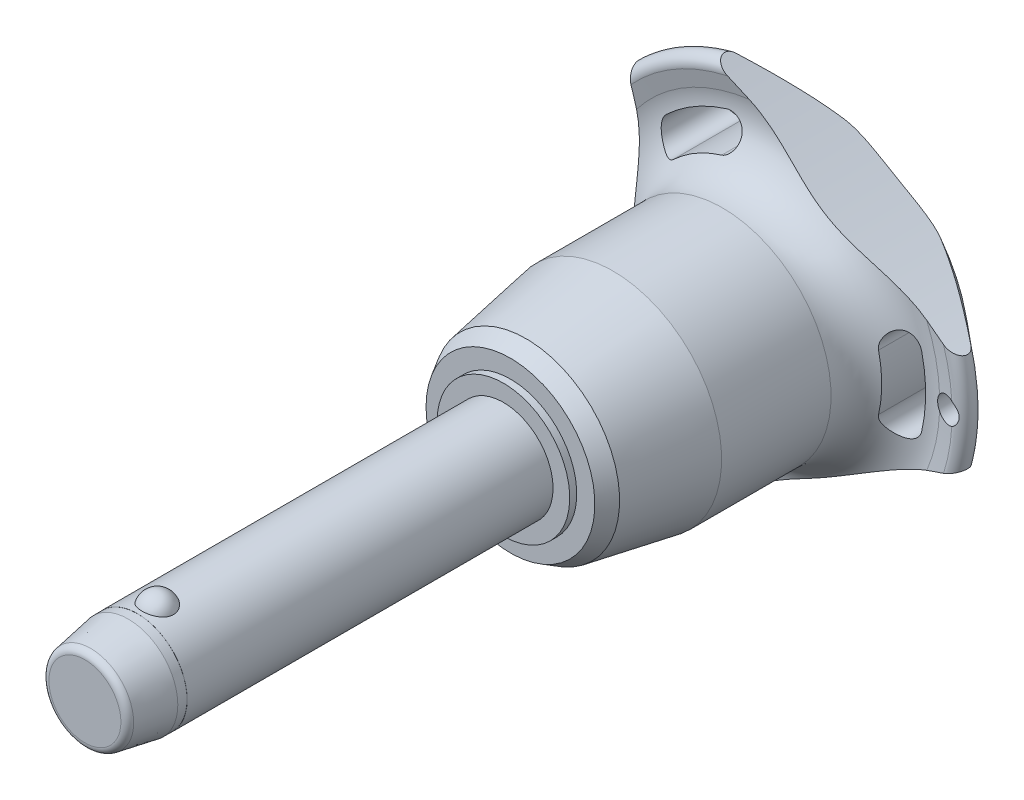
from build123d import *

# Parameters (mm, degrees)
SKETCH1_R           = 6
BOSS_EXTRUDE1_DEPTH = 40
SKETCH2_R           = 5.15
BOSS_EXTRUDE2_DEPTH = 39.7
BOSS_EXTRUDE3_START = 10.6
SKETCH1_2_R         = 6
BOSS_EXTRUDE3_DEPTH = 10.6
CHAMFER1_SIZE       = 5.3
CHAMFER1_SIZE2      = 0.934532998
FILLET1_R           = 0.85
SKETCH6_R           = 144.275
CUT_EXTRUDE1_DEPTH  = 87.518467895
CIRPATTERN1_COUNT   = 3
SKETCH7_R           = 1.5
CUT_EXTRUDE2_DEPTH  = 87.286194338
SKETCH8_R           = 6
SKETCH8_R_2         = 5.99
CUT_EXTRUDE3_DEPTH  = 6.36


with BuildPart() as part:
    # Sketch1 → Boss-Extrude1 (new body)
    with BuildSketch(Plane.XY):
        Circle(SKETCH1_R)
    extrude(amount=-BOSS_EXTRUDE1_DEPTH)

    # Sketch2 → Boss-Extrude2 (add)
    with BuildSketch(Plane(origin=(0, 0, -40), x_dir=(-1, 0, 0), z_dir=(0, 0, -1))):
        Circle(SKETCH2_R)
    extrude(amount=BOSS_EXTRUDE2_DEPTH)

    # Sketch3 → Revolve1 (revolve)
    with BuildSketch(Plane(origin=(0, 0, 0), x_dir=(0, 0, -1), z_dir=(1, 0, 0))):
        with BuildLine():
            Line((-1.854049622, 7.25), (-1.854049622, 3.25))
            ThreePointArc((-1.854049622, 3.25), (0.145950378, 5.25), (-1.854049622, 7.25))
        make_face()
        with BuildLine():
            Line((-1.854049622, -3.25), (-1.854049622, -7.25))
            ThreePointArc((-1.854049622, -7.25), (0.145950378, -5.25), (-1.854049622, -3.25))
        make_face()
    revolve(axis=Axis((0, -3.25, 1.854049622), (0, 1, 0)))

    # Sketch1_2 → Boss-Extrude3 (add)
    with BuildSketch(Plane.XY.offset(BOSS_EXTRUDE3_START)):
        Circle(SKETCH1_2_R)
    extrude(amount=-BOSS_EXTRUDE3_DEPTH)

    # Chamfer1
    chamfer1_edges = [part.edges().sort_by_distance(p)[0] for p in [
        (-6, 0, 10.6),
    ]]
    chamfer1_side = [part.faces().sort_by_distance(p)[0] for p in [
        (-6, 0, -14.7),
    ]]
    chamfer(chamfer1_edges, length=CHAMFER1_SIZE, length2=CHAMFER1_SIZE2, reference=chamfer1_side[0])

    # Fillet1
    fillet1_edges = [part.edges().sort_by_distance(p)[0] for p in [
        (-5.065467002, 0, 10.6),
        (5.15, 0, -79.7),
    ]]
    fillet(fillet1_edges, radius=FILLET1_R)

    # Sketch4 → Revolve2 (revolve)
    with BuildSketch(Plane(origin=(0, 0, 0), x_dir=(0, 0, -1), z_dir=(1, 0, 0)), mode=Mode.PRIVATE) as revolve2_sk:
        Polygon((40, 0), (40, 8.017240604), (40.85, 8.017240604), (40.85, 10.206249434), (42.745737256, 11.300753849), (53.233333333, 13.15), (66.466666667, 13.15), (66.466666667, 0), align=None)
    revolve(revolve2_sk.sketch.rotate(Axis((0, 0, -66.466666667), (0, 0, 1)), 90), axis=Axis((0, 0, -66.466666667), (0, 0, 1)))

    # Sketch5 → Revolve3 (revolve)
    with BuildSketch(Plane(origin=(0, 0, 0), x_dir=(0, 0, -1), z_dir=(1, 0, 0)), mode=Mode.PRIVATE) as revolve3_sk:
        with BuildLine():
            Line((72.32877039, 20.428960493), (71.910912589, 22.344207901))
            ThreePointArc((71.910912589, 22.344207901), (72.554394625, 23.677136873), (74.002586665, 23.371345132))
            Line((74.002586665, 23.371345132), (79.141488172, 17.247040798))
            ThreePointArc((79.141488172, 17.247040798), (79.7, 15.584758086), (78.978803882, 13.986322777))
            ThreePointArc((78.978803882, 13.986322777), (74.617427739, 7.589034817), (73.083333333, 0))
            Line((73.083333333, 0), (66.466666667, 0))
            Line((66.466666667, 0), (66.466666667, 13.15))
            ThreePointArc((66.466666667, 13.15), (71.139661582, 15.38660811), (72.32877039, 20.428960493))
        make_face()
    revolve(revolve3_sk.sketch.rotate(Axis((0, 0, -73.083333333), (0, 0, 1)), 90), axis=Axis((0, 0, -73.083333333), (0, 0, 1)))

    # Sketch6 → Cut-Extrude1 (cut, through all)
    with BuildSketch(Plane.XY):
        with Locations((-159.975, 0)):
            Circle(SKETCH6_R)
        with BuildLine():
            ThreePointArc((18.131206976, -4.190753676), (18.60922037, 0), (18.131206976, 4.190753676))
            ThreePointArc((18.131206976, 4.190753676), (15.94840906, 5.553949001), (14.585213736, 3.371151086))
            ThreePointArc((14.585213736, 3.371151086), (14.969740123, 0), (14.585213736, -3.371151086))
            ThreePointArc((14.585213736, -3.371151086), (15.94840906, -5.553949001), (18.131206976, -4.190753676))
        make_face()
    cut_extrude1 = extrude(amount=-CUT_EXTRUDE1_DEPTH, mode=Mode.SUBTRACT)

    # CirPattern1: Cut-Extrude1 ×3 about axis
    cirpattern1_axis = Axis((0, 0, 0), (0, 0, 1))
    for i in range(1, CIRPATTERN1_COUNT):
        add(cut_extrude1.rotate(cirpattern1_axis, i * 360 / CIRPATTERN1_COUNT), mode=Mode.SUBTRACT)

    # Sketch7 → Cut-Extrude2 (cut, through all)
    with BuildSketch(Plane.XY):
        with Locations(Location((21.60922037, 0, 0), (0, 0, 297.620773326))):
            Circle(SKETCH7_R)
    extrude(amount=-CUT_EXTRUDE2_DEPTH, mode=Mode.SUBTRACT)

    # Sketch8 → Cut-Extrude3 (cut)
    with BuildSketch(Plane.XY.offset(10.6)):
        Circle(SKETCH8_R)
        Circle(SKETCH8_R_2, mode=Mode.SUBTRACT)
    extrude(amount=-CUT_EXTRUDE3_DEPTH, mode=Mode.SUBTRACT)


solid = part.part
